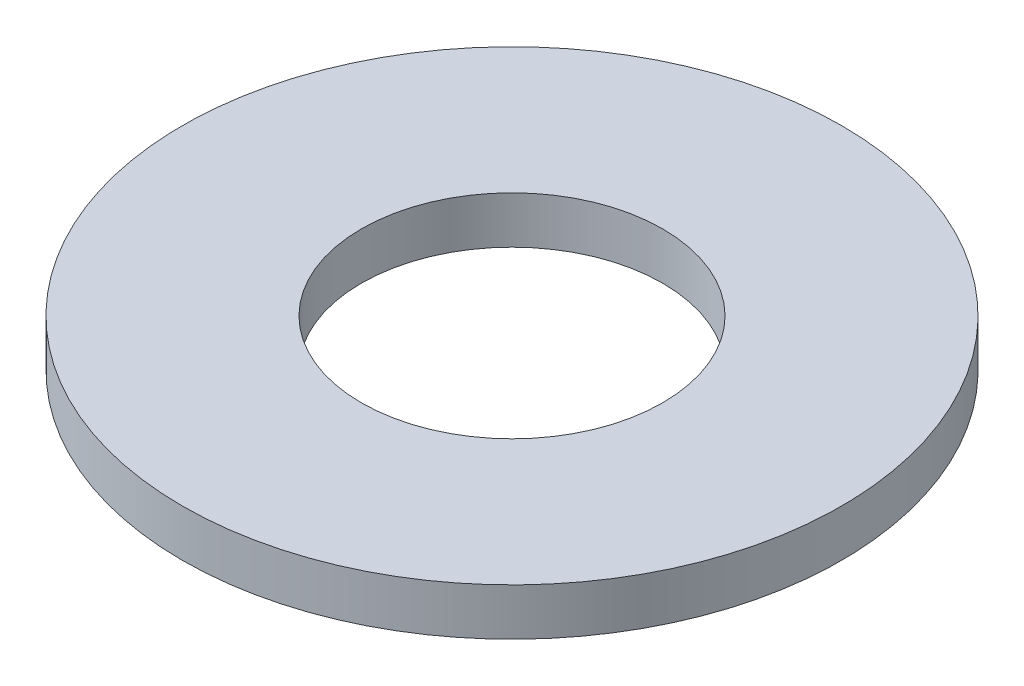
from build123d import *

# Parameters (mm, degrees)
SKETCH1_R      = 3.5
SKETCH1_R_2    = 1.6
EXTRUDE1_DEPTH = 0.5


with BuildPart() as part:
    # Sketch1 → Extrude1 (new body)
    with BuildSketch(Plane(origin=(0, 0, 0), x_dir=(1, 0, 0), z_dir=(0, 1, 0))):
        with Locations(Location((0, 0, 0), (0, 0, 270))):
            Circle(SKETCH1_R)
        with Locations(Location((0, 0, 0), (0, 0, 270))):
            Circle(SKETCH1_R_2, mode=Mode.SUBTRACT)
    extrude(amount=EXTRUDE1_DEPTH)


solid = part.part
